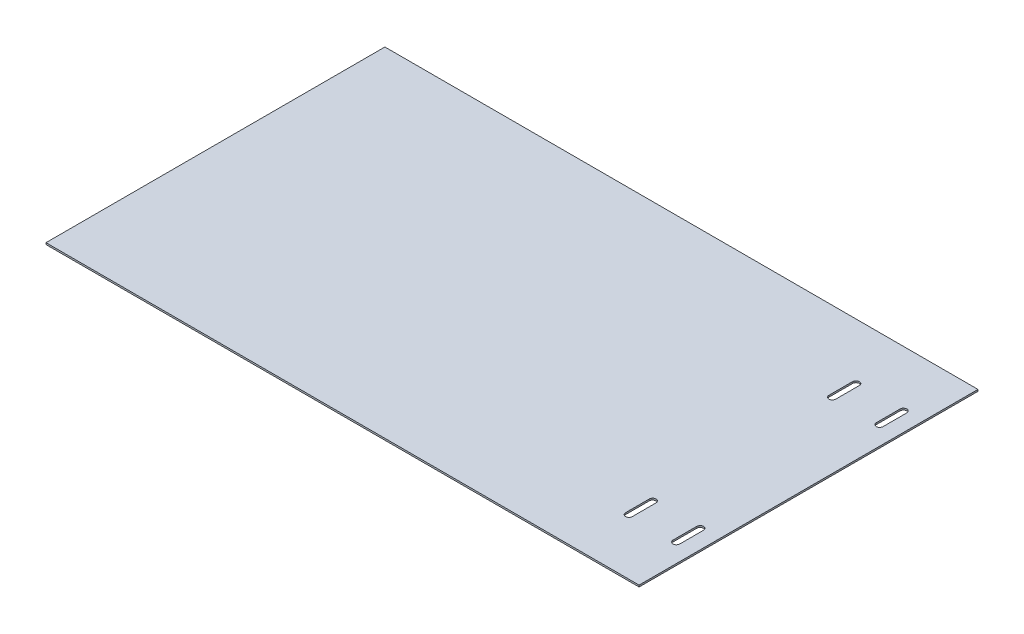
from build123d import *

# Parameters (mm, degrees)
SKETCH1_W           = 350
SKETCH1_H           = 200
BOSS_EXTRUDE1_DEPTH = 1
CUT_EXTRUDE1_DEPTH  = 203.5315407


with BuildPart() as part:
    # Sketch1 → Boss-Extrude1 (new body)
    with BuildSketch(Plane(origin=(0, 0, 0), x_dir=(1, 0, 0), z_dir=(0, 1, 0))):
        with Locations((1.119348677, 0)):
            Rectangle(SKETCH1_W, SKETCH1_H)
    extrude(amount=BOSS_EXTRUDE1_DEPTH)

    # Sketch2 → Cut-Extrude1 (cut, through all)
    with BuildSketch(Plane(origin=(0, 1, 0), x_dir=(1, 0, 0), z_dir=(0, 1, 0))):
        with BuildLine():
            Line((167.119348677, -67), (167.119348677, -53))
            ThreePointArc((167.119348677, -53), (165.119348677, -51), (163.119348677, -53))
            Line((163.119348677, -53), (163.119348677, -67))
            ThreePointArc((163.119348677, -67), (165.119348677, -69), (167.119348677, -67))
        make_face()
        with BuildLine():
            Line((139.119348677, -67), (139.119348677, -53))
            ThreePointArc((139.119348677, -53), (137.119348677, -51), (135.119348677, -53))
            Line((135.119348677, -53), (135.119348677, -67))
            ThreePointArc((135.119348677, -67), (137.119348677, -69), (139.119348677, -67))
        make_face()
        with BuildLine():
            Line((135.119348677, 67), (135.119348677, 53))
            ThreePointArc((135.119348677, 53), (137.119348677, 51), (139.119348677, 53))
            Line((139.119348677, 53), (139.119348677, 67))
            ThreePointArc((139.119348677, 67), (137.119348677, 69), (135.119348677, 67))
        make_face()
        with BuildLine():
            Line((163.119348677, 67), (163.119348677, 53))
            ThreePointArc((163.119348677, 53), (165.119348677, 51), (167.119348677, 53))
            Line((167.119348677, 53), (167.119348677, 67))
            ThreePointArc((167.119348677, 67), (165.119348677, 69), (163.119348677, 67))
        make_face()
    extrude(amount=-CUT_EXTRUDE1_DEPTH, mode=Mode.SUBTRACT)


solid = part.part
